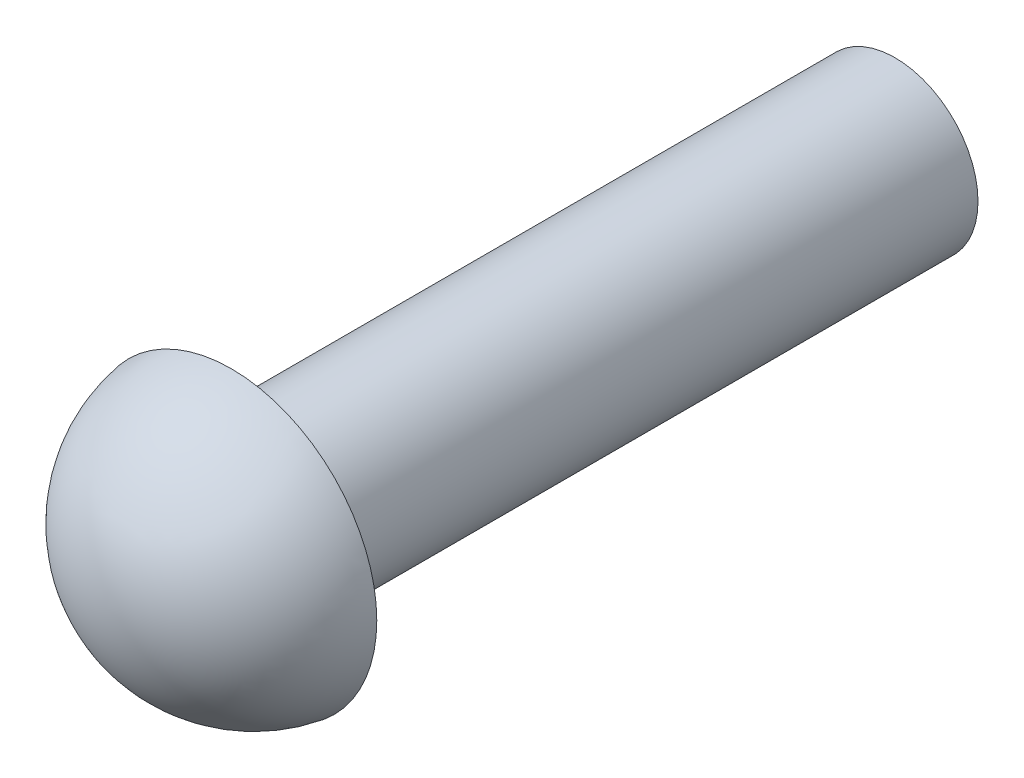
ISO-10303-21;
HEADER;
FILE_DESCRIPTION(('STEP AP214'),'2;1');
FILE_NAME('part.step','',(''),(''),'','','');
FILE_SCHEMA(('AUTOMOTIVE_DESIGN { 1 0 10303 214 1 1 1 1 }'));
ENDSEC;
DATA;
#1=APPLICATION_CONTEXT('core data for automotive mechanical design processes');
#2=APPLICATION_PROTOCOL_DEFINITION('international standard','automotive_design',2000,#1);
#3=PRODUCT_CONTEXT('',#1,'mechanical');
#4=PRODUCT('Part','Part','',(#3));
#5=PRODUCT_RELATED_PRODUCT_CATEGORY('part','',(#4));
#6=PRODUCT_DEFINITION_FORMATION('','',#4);
#7=PRODUCT_DEFINITION_CONTEXT('part definition',#1,'design');
#8=PRODUCT_DEFINITION('design','',#6,#7);
#9=PRODUCT_DEFINITION_SHAPE('','',#8);
#10=(LENGTH_UNIT() NAMED_UNIT(*) SI_UNIT(.MILLI.,.METRE.));
#11=(NAMED_UNIT(*) PLANE_ANGLE_UNIT() SI_UNIT($,.RADIAN.));
#12=(NAMED_UNIT(*) SI_UNIT($,.STERADIAN.) SOLID_ANGLE_UNIT());
#13=UNCERTAINTY_MEASURE_WITH_UNIT(LENGTH_MEASURE(1.E-05),#10,'distance_accuracy_value','');
#14=(GEOMETRIC_REPRESENTATION_CONTEXT(3) GLOBAL_UNCERTAINTY_ASSIGNED_CONTEXT((#13)) GLOBAL_UNIT_ASSIGNED_CONTEXT((#10,
#11,#12)) REPRESENTATION_CONTEXT('',''));
#15=CARTESIAN_POINT('',(0.,0.,0.));
#16=DIRECTION('',(0.,0.,1.));
#17=DIRECTION('',(1.,0.,0.));
#18=AXIS2_PLACEMENT_3D('',#15,#16,#17);
#19=CARTESIAN_POINT('',(0.,0.,-5.62751861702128));
#20=DIRECTION('',(0.,0.,1.));
#21=DIRECTION('',(-1.,0.,0.));
#22=AXIS2_PLACEMENT_3D('',#19,#20,#21);
#23=SPHERICAL_SURFACE('',#22,5.62751861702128);
#24=CARTESIAN_POINT('',(0.,0.,-4.7752));
#25=DIRECTION('',(0.,0.,1.));
#26=DIRECTION('',(1.,0.,0.));
#27=AXIS2_PLACEMENT_3D('',#24,#25,#26);
#28=CIRCLE('',#27,5.5626);
#29=CARTESIAN_POINT('',(5.5626,0.,-4.7752));
#30=VERTEX_POINT('',#29);
#31=EDGE_CURVE('E41',#30,#30,#28,.T.);
#32=ORIENTED_EDGE('',*,*,#31,.T.);
#33=EDGE_LOOP('',(#32));
#34=FACE_BOUND('',#33,.T.);
#35=ADVANCED_FACE('F31',(#34),#23,.T.);
#36=CARTESIAN_POINT('',(0.,0.,-30.1752));
#37=DIRECTION('',(0.,0.,1.));
#38=DIRECTION('',(1.,0.,0.));
#39=AXIS2_PLACEMENT_3D('',#36,#37,#38);
#40=PLANE('',#39);
#41=CARTESIAN_POINT('',(0.,0.,-30.1752));
#42=DIRECTION('',(0.,0.,1.));
#43=DIRECTION('',(1.,0.,0.));
#44=AXIS2_PLACEMENT_3D('',#41,#42,#43);
#45=CIRCLE('',#44,3.175);
#46=CARTESIAN_POINT('',(3.175,0.,-30.1752));
#47=VERTEX_POINT('',#46);
#48=EDGE_CURVE('E10',#47,#47,#45,.T.);
#49=ORIENTED_EDGE('',*,*,#48,.F.);
#50=EDGE_LOOP('',(#49));
#51=FACE_BOUND('',#50,.T.);
#52=ADVANCED_FACE('F56',(#51),#40,.F.);
#53=CARTESIAN_POINT('',(0.,0.,0.));
#54=DIRECTION('',(0.,0.,1.));
#55=DIRECTION('',(1.,0.,0.));
#56=AXIS2_PLACEMENT_3D('',#53,#54,#55);
#57=CYLINDRICAL_SURFACE('',#56,3.175);
#58=CARTESIAN_POINT('',(0.,0.,-4.7752));
#59=DIRECTION('',(0.,0.,1.));
#60=DIRECTION('',(1.,0.,0.));
#61=AXIS2_PLACEMENT_3D('',#58,#59,#60);
#62=CIRCLE('',#61,3.175);
#63=CARTESIAN_POINT('',(3.175,0.,-4.7752));
#64=VERTEX_POINT('',#63);
#65=EDGE_CURVE('E37',#64,#64,#62,.T.);
#66=ORIENTED_EDGE('',*,*,#65,.F.);
#67=EDGE_LOOP('',(#66));
#68=FACE_BOUND('',#67,.T.);
#69=ORIENTED_EDGE('',*,*,#48,.T.);
#70=EDGE_LOOP('',(#69));
#71=FACE_BOUND('',#70,.T.);
#72=ADVANCED_FACE('F51',(#68,#71),#57,.T.);
#73=CARTESIAN_POINT('',(-5.5626,0.,-4.7752));
#74=DIRECTION('',(0.,0.,1.));
#75=DIRECTION('',(1.,0.,0.));
#76=AXIS2_PLACEMENT_3D('',#73,#74,#75);
#77=PLANE('',#76);
#78=ORIENTED_EDGE('',*,*,#31,.F.);
#79=EDGE_LOOP('',(#78));
#80=FACE_BOUND('',#79,.T.);
#81=ORIENTED_EDGE('',*,*,#65,.T.);
#82=EDGE_LOOP('',(#81));
#83=FACE_BOUND('',#82,.T.);
#84=ADVANCED_FACE('F49',(#80,#83),#77,.F.);
#85=CLOSED_SHELL('',(#35,#52,#72,#84));
#86=MANIFOLD_SOLID_BREP('B2',#85);
#87=ADVANCED_BREP_SHAPE_REPRESENTATION('',(#18,#86),#14);
#88=SHAPE_DEFINITION_REPRESENTATION(#9,#87);
ENDSEC;
END-ISO-10303-21;
